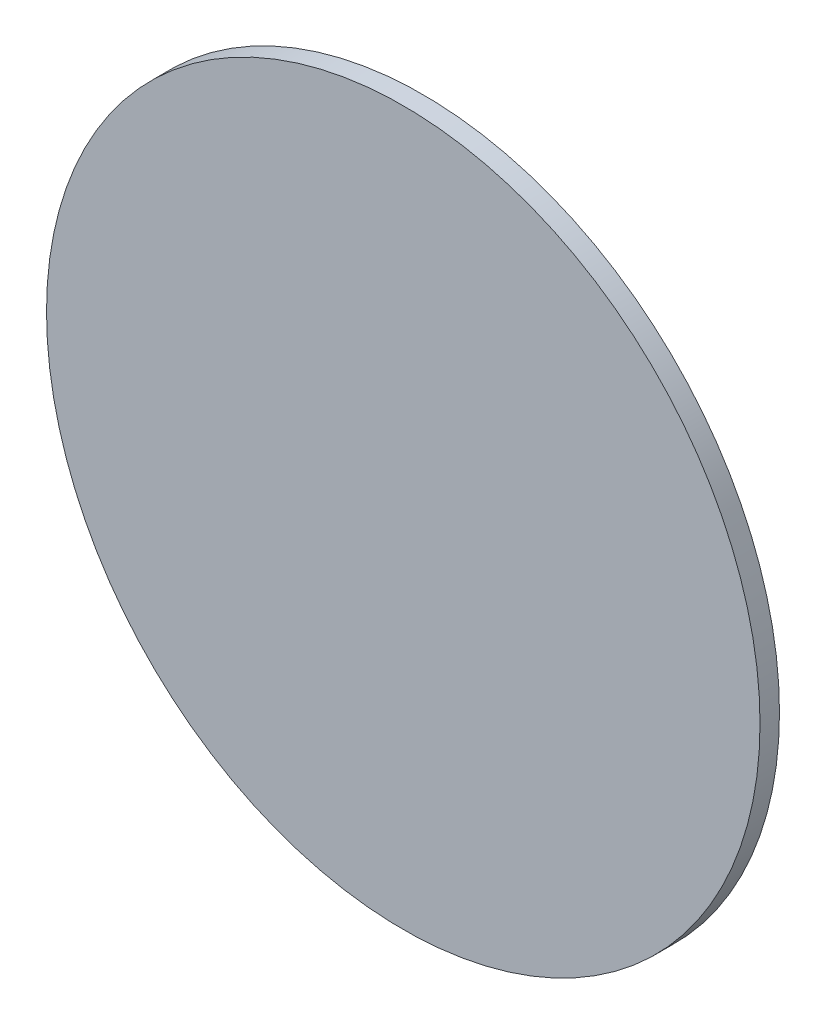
from build123d import *

# Parameters (mm, degrees)
ESQUISSE1_R        = 55
BOSS_EXTRU_1_DEPTH = 3


with BuildPart() as part:
    # Esquisse1 → Boss.-Extru.1 (new body)
    with BuildSketch(Plane.XY):
        with Locations((0.597067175, -0.60494215)):
            Circle(ESQUISSE1_R)
    extrude(amount=BOSS_EXTRU_1_DEPTH)


solid = part.part
